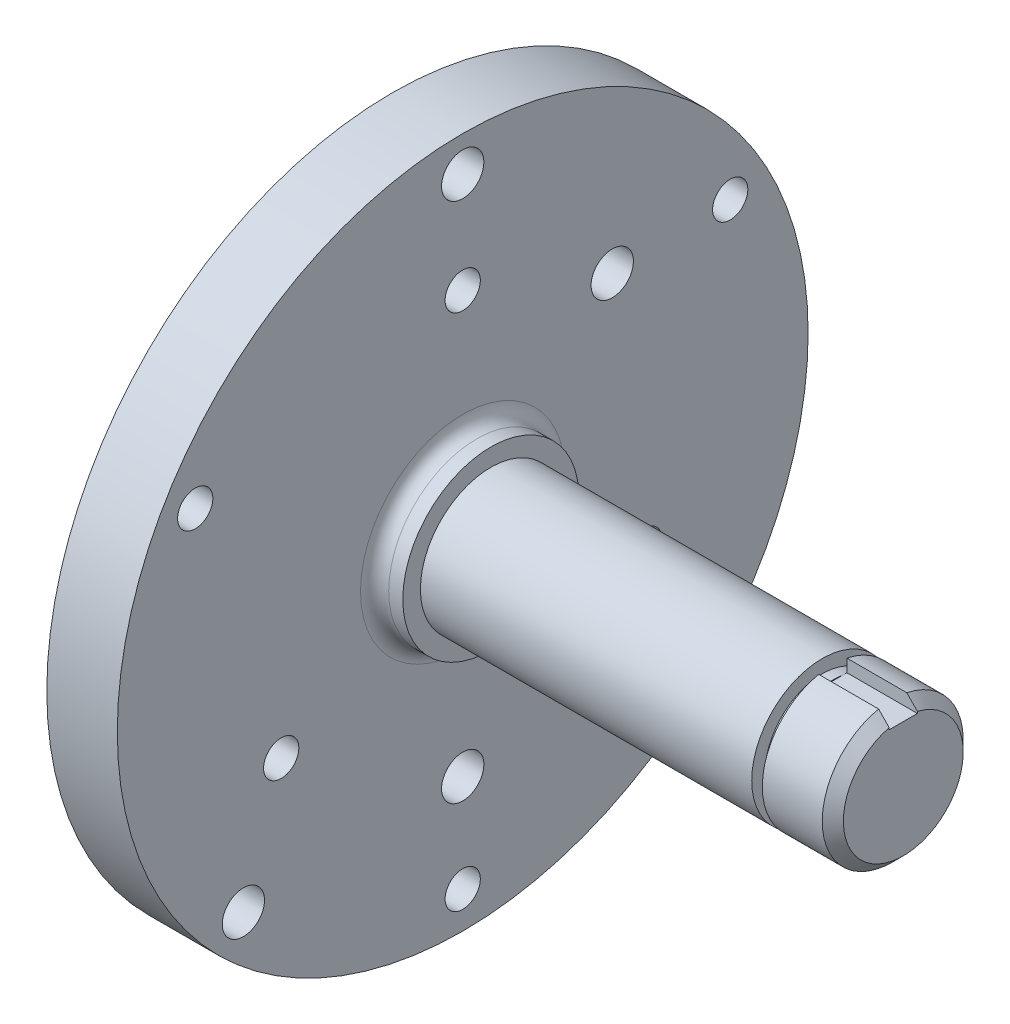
from build123d import *

# Parameters (mm, degrees)
ENL_V_MAT_EXTRU_1_REACH      = 102.291
ESQUISSE2_R                  = 3
TROU_TARAUD_M61_D            = 5
R_P_TITION_CIRCULAIRE1_COUNT = 3
ENL_V_MAT_EXTRU_4_REACH      = 102.291
ESQUISSE4_W                  = 4
ESQUISSE4_H                  = 4.231945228


with BuildPart() as part:
    # Esquisse1 → R_volution1 (revolve)
    with BuildSketch(Plane.XY, mode=Mode.PRIVATE) as r_volution1_sk:
        with BuildLine():
            Line((-14, 0), (-14, 49))
            Line((-14, 49), (-4, 49))
            Line((-4, 49), (-4, 14.5))
            ThreePointArc((-4, 14.5), (-3.414213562, 13.085786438), (-2, 12.5))
            Line((-2, 12.5), (0, 12.5))
            Line((0, 12.5), (0, 10))
            Line((0, 10), (47, 10))
            Line((47, 10), (47, 8.12772302))
            Line((47, 8.12772302), (48.5, 8.12772302))
            Line((48.5, 8.12772302), (48.5, 10))
            Line((48.5, 10), (57, 10))
            Line((57, 10), (58.5, 8.5))
            Line((58.5, 8.5), (58.5, 0))
            Line((58.5, 0), (-14, 0))
        make_face()
    revolve(r_volution1_sk.sketch.rotate(Axis((-18.286431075, 0, 0), (1, 0, 0)), 90), axis=Axis((-18.286431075, 0, 0), (1, 0, 0)))

    # Esquisse2 → Enl_v. mat.-Extru.1 (cut, up to next)
    with BuildSketch(Plane.ZY.offset(14), mode=Mode.PRIVATE) as enl_v_mat_extru_1_sk1:
        with Locations((0, -30)):
            Circle(ESQUISSE2_R)
    enl_v_mat_extru_1_tool1 = extrude(enl_v_mat_extru_1_sk1.sketch, amount=-ENL_V_MAT_EXTRU_1_REACH, mode=Mode.PRIVATE) & part.part
    # Esquisse2 → Enl_v. mat.-Extru.1 (cut, up to next)
    with BuildSketch(Plane.ZY.offset(14), mode=Mode.PRIVATE) as enl_v_mat_extru_1_sk2:
        with Locations((-21.213203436, 21.213203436)):
            Circle(ESQUISSE2_R)
    enl_v_mat_extru_1_tool2 = extrude(enl_v_mat_extru_1_sk2.sketch, amount=-ENL_V_MAT_EXTRU_1_REACH, mode=Mode.PRIVATE) & part.part
    # Esquisse2 → Enl_v. mat.-Extru.1 (cut, up to next)
    with BuildSketch(Plane.ZY.offset(14), mode=Mode.PRIVATE) as enl_v_mat_extru_1_sk3:
        with Locations((0, 44)):
            Circle(ESQUISSE2_R)
    enl_v_mat_extru_1_tool3 = extrude(enl_v_mat_extru_1_sk3.sketch, amount=-ENL_V_MAT_EXTRU_1_REACH, mode=Mode.PRIVATE) & part.part
    # Esquisse2 → Enl_v. mat.-Extru.1 (cut, up to next)
    with BuildSketch(Plane.ZY.offset(14), mode=Mode.PRIVATE) as enl_v_mat_extru_1_sk4:
        with Locations((31.112698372, -31.112698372)):
            Circle(ESQUISSE2_R)
    enl_v_mat_extru_1_tool4 = extrude(enl_v_mat_extru_1_sk4.sketch, amount=-ENL_V_MAT_EXTRU_1_REACH, mode=Mode.PRIVATE) & part.part
    add(enl_v_mat_extru_1_tool1.solids().sort_by_distance((-14, -30, 0))[0], mode=Mode.SUBTRACT)
    add(enl_v_mat_extru_1_tool2.solids().sort_by_distance((-14, 21.213203, -21.213203))[0], mode=Mode.SUBTRACT)
    add(enl_v_mat_extru_1_tool3.solids().sort_by_distance((-14, 44, 0))[0], mode=Mode.SUBTRACT)
    add(enl_v_mat_extru_1_tool4.solids().sort_by_distance((-14, -31.112698, 31.112698))[0], mode=Mode.SUBTRACT)

    # Trou taraud_ M61 (through all)
    with Locations(Plane(origin=(-4, 29.732137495, 0), x_dir=(0, 0, 1), z_dir=(1, 0, 0))):
        with Locations((0, 0), (0, 73.549942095)):
            trou_taraud_m61 = Hole(TROU_TARAUD_M61_D / 2)

    # R_p_tition circulaire1: Trou taraud_ M61 ×3 about axis
    r_p_tition_circulaire1_axis = Axis((0, 0, 0), (1, 0, 0))
    for i in range(1, R_P_TITION_CIRCULAIRE1_COUNT):
        add(trou_taraud_m61.rotate(r_p_tition_circulaire1_axis, i * 360 / R_P_TITION_CIRCULAIRE1_COUNT), mode=Mode.SUBTRACT)

    # Enl_v. mat.-Extru.4: up to this face of the body (flat: up to its plane)
    enl_v_mat_extru_4_end = Plane(part.part.faces().sort_by_distance((48.5, 0, -8.410565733))[0])
    # Esquisse4 → Enl_v. mat.-Extru.4 (cut, up to the picked face)
    with BuildSketch(Plane(origin=(58.5, 0, 0), x_dir=(0, 0, -1), z_dir=(1, 0, 0)), mode=Mode.PRIVATE) as enl_v_mat_extru_4_sk1:
        with Locations((0, 10.115972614)):
            Rectangle(ESQUISSE4_W, ESQUISSE4_H)
    enl_v_mat_extru_4_tool1 = split(extrude(enl_v_mat_extru_4_sk1.sketch, amount=-ENL_V_MAT_EXTRU_4_REACH, mode=Mode.PRIVATE), bisect_by=enl_v_mat_extru_4_end, keep=Keep.BOTH, mode=Mode.PRIVATE)
    add(enl_v_mat_extru_4_tool1.solids().sort_by(Axis((58.5, 10.115973, 0), (-1, 0, 0)))[0], mode=Mode.SUBTRACT)


solid = part.part
